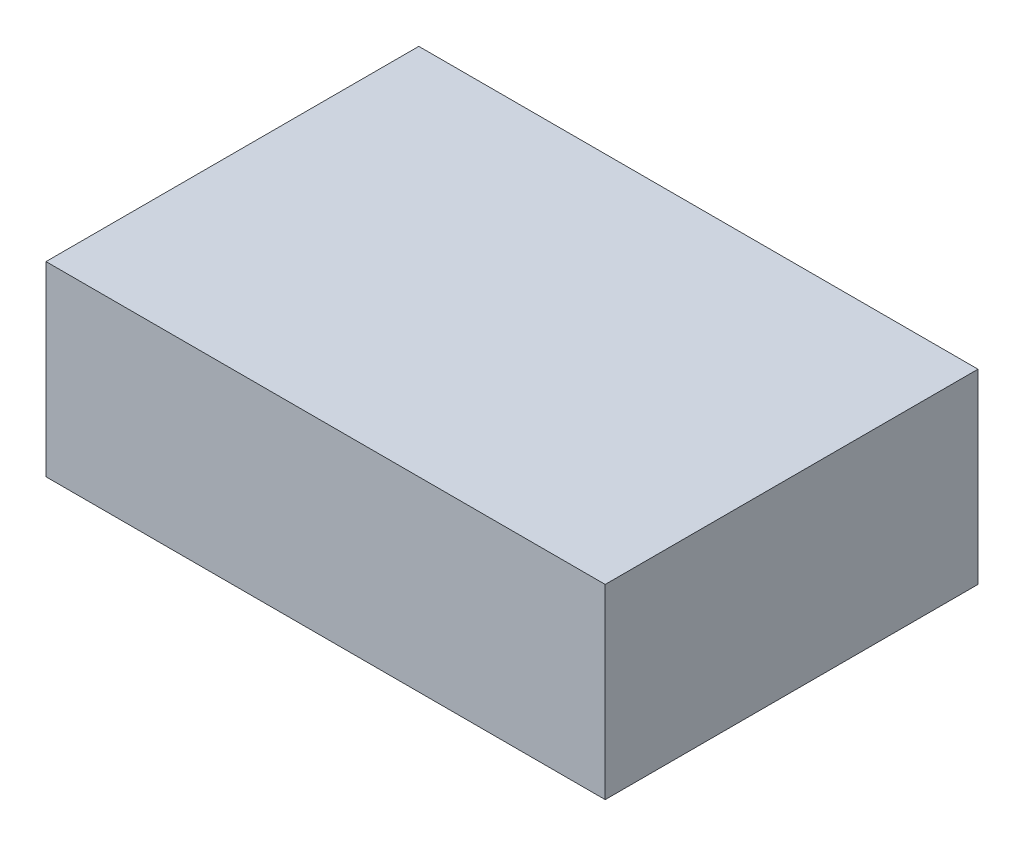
ISO-10303-21;
HEADER;
FILE_DESCRIPTION(('STEP AP214'),'2;1');
FILE_NAME('part.step','',(''),(''),'','','');
FILE_SCHEMA(('AUTOMOTIVE_DESIGN { 1 0 10303 214 1 1 1 1 }'));
ENDSEC;
DATA;
#1=APPLICATION_CONTEXT('core data for automotive mechanical design processes');
#2=APPLICATION_PROTOCOL_DEFINITION('international standard','automotive_design',2000,#1);
#3=PRODUCT_CONTEXT('',#1,'mechanical');
#4=PRODUCT('Part','Part','',(#3));
#5=PRODUCT_RELATED_PRODUCT_CATEGORY('part','',(#4));
#6=PRODUCT_DEFINITION_FORMATION('','',#4);
#7=PRODUCT_DEFINITION_CONTEXT('part definition',#1,'design');
#8=PRODUCT_DEFINITION('design','',#6,#7);
#9=PRODUCT_DEFINITION_SHAPE('','',#8);
#10=(LENGTH_UNIT() NAMED_UNIT(*) SI_UNIT(.MILLI.,.METRE.));
#11=(NAMED_UNIT(*) PLANE_ANGLE_UNIT() SI_UNIT($,.RADIAN.));
#12=(NAMED_UNIT(*) SI_UNIT($,.STERADIAN.) SOLID_ANGLE_UNIT());
#13=UNCERTAINTY_MEASURE_WITH_UNIT(LENGTH_MEASURE(1.E-05),#10,'distance_accuracy_value','');
#14=(GEOMETRIC_REPRESENTATION_CONTEXT(3) GLOBAL_UNCERTAINTY_ASSIGNED_CONTEXT((#13)) GLOBAL_UNIT_ASSIGNED_CONTEXT((#10,
#11,#12)) REPRESENTATION_CONTEXT('',''));
#15=CARTESIAN_POINT('',(0.,0.,0.));
#16=DIRECTION('',(0.,0.,1.));
#17=DIRECTION('',(1.,0.,0.));
#18=AXIS2_PLACEMENT_3D('',#15,#16,#17);
#19=CARTESIAN_POINT('',(0.,0.,10.));
#20=DIRECTION('',(1.,0.,0.));
#21=DIRECTION('',(0.,0.,-1.));
#22=AXIS2_PLACEMENT_3D('',#19,#20,#21);
#23=PLANE('',#22);
#24=DIRECTION('',(0.,-1.,0.));
#25=VECTOR('',#24,1.);
#26=CARTESIAN_POINT('',(0.,0.,-10.));
#27=LINE('',#26,#25);
#28=CARTESIAN_POINT('',(0.,10.,-10.));
#29=VERTEX_POINT('',#28);
#30=CARTESIAN_POINT('',(0.,0.,-10.));
#31=VERTEX_POINT('',#30);
#32=EDGE_CURVE('E96',#29,#31,#27,.T.);
#33=ORIENTED_EDGE('',*,*,#32,.T.);
#34=DIRECTION('',(0.,0.,-1.));
#35=VECTOR('',#34,1.);
#36=CARTESIAN_POINT('',(0.,0.,10.));
#37=LINE('',#36,#35);
#38=CARTESIAN_POINT('',(0.,0.,10.));
#39=VERTEX_POINT('',#38);
#40=EDGE_CURVE('E11',#39,#31,#37,.T.);
#41=ORIENTED_EDGE('',*,*,#40,.F.);
#42=DIRECTION('',(0.,-1.,0.));
#43=VECTOR('',#42,1.);
#44=CARTESIAN_POINT('',(0.,0.,10.));
#45=LINE('',#44,#43);
#46=CARTESIAN_POINT('',(0.,10.,10.));
#47=VERTEX_POINT('',#46);
#48=EDGE_CURVE('E84',#47,#39,#45,.T.);
#49=ORIENTED_EDGE('',*,*,#48,.F.);
#50=DIRECTION('',(0.,0.,-1.));
#51=VECTOR('',#50,1.);
#52=CARTESIAN_POINT('',(0.,10.,10.));
#53=LINE('',#52,#51);
#54=EDGE_CURVE('E92',#47,#29,#53,.T.);
#55=ORIENTED_EDGE('',*,*,#54,.T.);
#56=EDGE_LOOP('',(#33,#41,#49,#55));
#57=FACE_BOUND('',#56,.T.);
#58=ADVANCED_FACE('F33',(#57),#23,.F.);
#59=CARTESIAN_POINT('',(0.,0.,10.));
#60=DIRECTION('',(0.,1.,0.));
#61=DIRECTION('',(0.,0.,1.));
#62=AXIS2_PLACEMENT_3D('',#59,#60,#61);
#63=PLANE('',#62);
#64=DIRECTION('',(1.,0.,0.));
#65=VECTOR('',#64,1.);
#66=CARTESIAN_POINT('',(0.,0.,-10.));
#67=LINE('',#66,#65);
#68=CARTESIAN_POINT('',(30.,0.,-10.));
#69=VERTEX_POINT('',#68);
#70=EDGE_CURVE('E88',#31,#69,#67,.T.);
#71=ORIENTED_EDGE('',*,*,#70,.T.);
#72=DIRECTION('',(0.,0.,-1.));
#73=VECTOR('',#72,1.);
#74=CARTESIAN_POINT('',(30.,0.,10.));
#75=LINE('',#74,#73);
#76=CARTESIAN_POINT('',(30.,0.,10.));
#77=VERTEX_POINT('',#76);
#78=EDGE_CURVE('E41',#77,#69,#75,.T.);
#79=ORIENTED_EDGE('',*,*,#78,.F.);
#80=DIRECTION('',(1.,0.,0.));
#81=VECTOR('',#80,1.);
#82=CARTESIAN_POINT('',(0.,0.,10.));
#83=LINE('',#82,#81);
#84=EDGE_CURVE('E79',#39,#77,#83,.T.);
#85=ORIENTED_EDGE('',*,*,#84,.F.);
#86=ORIENTED_EDGE('',*,*,#40,.T.);
#87=EDGE_LOOP('',(#71,#79,#85,#86));
#88=FACE_BOUND('',#87,.T.);
#89=ADVANCED_FACE('F87',(#88),#63,.F.);
#90=CARTESIAN_POINT('',(30.,0.,10.));
#91=DIRECTION('',(-1.,0.,0.));
#92=DIRECTION('',(0.,0.,1.));
#93=AXIS2_PLACEMENT_3D('',#90,#91,#92);
#94=PLANE('',#93);
#95=DIRECTION('',(0.,1.,0.));
#96=VECTOR('',#95,1.);
#97=CARTESIAN_POINT('',(30.,0.,-10.));
#98=LINE('',#97,#96);
#99=CARTESIAN_POINT('',(30.,10.,-10.));
#100=VERTEX_POINT('',#99);
#101=EDGE_CURVE('E66',#69,#100,#98,.T.);
#102=ORIENTED_EDGE('',*,*,#101,.T.);
#103=DIRECTION('',(0.,0.,-1.));
#104=VECTOR('',#103,1.);
#105=CARTESIAN_POINT('',(30.,10.,10.));
#106=LINE('',#105,#104);
#107=CARTESIAN_POINT('',(30.,10.,10.));
#108=VERTEX_POINT('',#107);
#109=EDGE_CURVE('E89',#108,#100,#106,.T.);
#110=ORIENTED_EDGE('',*,*,#109,.F.);
#111=DIRECTION('',(0.,1.,0.));
#112=VECTOR('',#111,1.);
#113=CARTESIAN_POINT('',(30.,0.,10.));
#114=LINE('',#113,#112);
#115=EDGE_CURVE('E82',#77,#108,#114,.T.);
#116=ORIENTED_EDGE('',*,*,#115,.F.);
#117=ORIENTED_EDGE('',*,*,#78,.T.);
#118=EDGE_LOOP('',(#102,#110,#116,#117));
#119=FACE_BOUND('',#118,.T.);
#120=ADVANCED_FACE('F90',(#119),#94,.F.);
#121=CARTESIAN_POINT('',(0.,10.,10.));
#122=DIRECTION('',(0.,-1.,0.));
#123=DIRECTION('',(0.,0.,-1.));
#124=AXIS2_PLACEMENT_3D('',#121,#122,#123);
#125=PLANE('',#124);
#126=DIRECTION('',(-1.,0.,0.));
#127=VECTOR('',#126,1.);
#128=CARTESIAN_POINT('',(0.,10.,-10.));
#129=LINE('',#128,#127);
#130=EDGE_CURVE('E72',#100,#29,#129,.T.);
#131=ORIENTED_EDGE('',*,*,#130,.T.);
#132=ORIENTED_EDGE('',*,*,#54,.F.);
#133=DIRECTION('',(-1.,0.,0.));
#134=VECTOR('',#133,1.);
#135=CARTESIAN_POINT('',(0.,10.,10.));
#136=LINE('',#135,#134);
#137=EDGE_CURVE('E49',#108,#47,#136,.T.);
#138=ORIENTED_EDGE('',*,*,#137,.F.);
#139=ORIENTED_EDGE('',*,*,#109,.T.);
#140=EDGE_LOOP('',(#131,#132,#138,#139));
#141=FACE_BOUND('',#140,.T.);
#142=ADVANCED_FACE('F103',(#141),#125,.F.);
#143=CARTESIAN_POINT('',(0.,10.,10.));
#144=DIRECTION('',(0.,0.,-1.));
#145=DIRECTION('',(-1.,0.,0.));
#146=AXIS2_PLACEMENT_3D('',#143,#144,#145);
#147=PLANE('',#146);
#148=ORIENTED_EDGE('',*,*,#48,.T.);
#149=ORIENTED_EDGE('',*,*,#84,.T.);
#150=ORIENTED_EDGE('',*,*,#115,.T.);
#151=ORIENTED_EDGE('',*,*,#137,.T.);
#152=EDGE_LOOP('',(#148,#149,#150,#151));
#153=FACE_BOUND('',#152,.T.);
#154=ADVANCED_FACE('F80',(#153),#147,.F.);
#155=CARTESIAN_POINT('',(0.,10.,-10.));
#156=DIRECTION('',(0.,0.,-1.));
#157=DIRECTION('',(-1.,0.,0.));
#158=AXIS2_PLACEMENT_3D('',#155,#156,#157);
#159=PLANE('',#158);
#160=ORIENTED_EDGE('',*,*,#32,.F.);
#161=ORIENTED_EDGE('',*,*,#130,.F.);
#162=ORIENTED_EDGE('',*,*,#101,.F.);
#163=ORIENTED_EDGE('',*,*,#70,.F.);
#164=EDGE_LOOP('',(#160,#161,#162,#163));
#165=FACE_BOUND('',#164,.T.);
#166=ADVANCED_FACE('F106',(#165),#159,.T.);
#167=CLOSED_SHELL('',(#58,#89,#120,#142,#154,#166));
#168=MANIFOLD_SOLID_BREP('B2',#167);
#169=ADVANCED_BREP_SHAPE_REPRESENTATION('',(#18,#168),#14);
#170=SHAPE_DEFINITION_REPRESENTATION(#9,#169);
ENDSEC;
END-ISO-10303-21;
